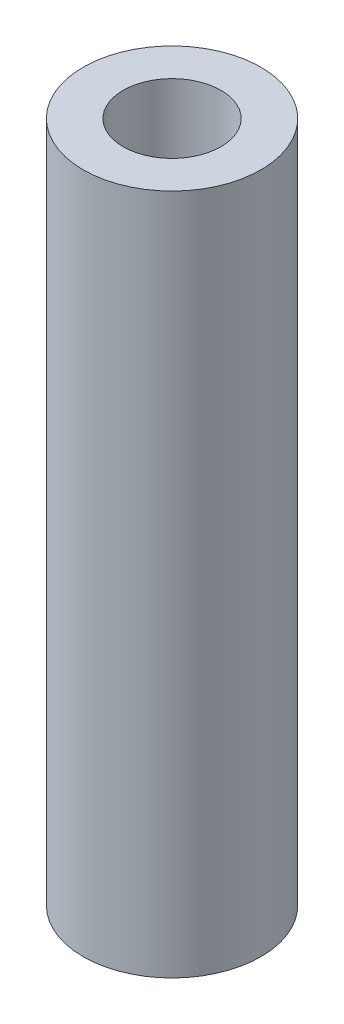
from build123d import *

# Parameters (mm, degrees)
SKETCH1_R     = 3
SKETCH1_R_2   = 1.65
F_23MM_DEPTH  = 23
SKETCH1_2_R   = 3
SKETCH1_2_R_2 = 1.65
F_1MM_DEPTH   = 1
SKETCH1_3_R   = 3
SKETCH1_3_R_2 = 1.65
F_0_5MM_DEPTH = 0.5


with BuildPart() as part:
    # Sketch1 → 23mm (new body)
    with BuildSketch(Plane(origin=(0, 0, 0), x_dir=(1, 0, 0), z_dir=(0, 1, 0))):
        with Locations(Location((0, 0, 0), (0, 0, 270))):
            Circle(SKETCH1_R)
        with Locations(Location((0, 0, 0), (0, 0, 270))):
            Circle(SKETCH1_R_2, mode=Mode.SUBTRACT)
    extrude(amount=F_23MM_DEPTH)


with BuildPart() as body_2:
    # Sketch1_2 → 1mm (new body)
    with BuildSketch(Plane(origin=(0, 0, 0), x_dir=(1, 0, 0), z_dir=(0, 1, 0))):
        with Locations(Location((0, 0, 0), (0, 0, 270))):
            Circle(SKETCH1_2_R)
        with Locations(Location((0, 0, 0), (0, 0, 270))):
            Circle(SKETCH1_2_R_2, mode=Mode.SUBTRACT)
    extrude(amount=F_1MM_DEPTH)


with BuildPart() as body_3:
    # Sketch1_3 → 0.5mm (new body)
    with BuildSketch(Plane(origin=(0, 0, 0), x_dir=(1, 0, 0), z_dir=(0, 1, 0))):
        with Locations(Location((0, 0, 0), (0, 0, 270))):
            Circle(SKETCH1_3_R)
        with Locations(Location((0, 0, 0), (0, 0, 270))):
            Circle(SKETCH1_3_R_2, mode=Mode.SUBTRACT)
    extrude(amount=F_0_5MM_DEPTH)


solid = Compound([part.part, body_2.part, body_3.part])
